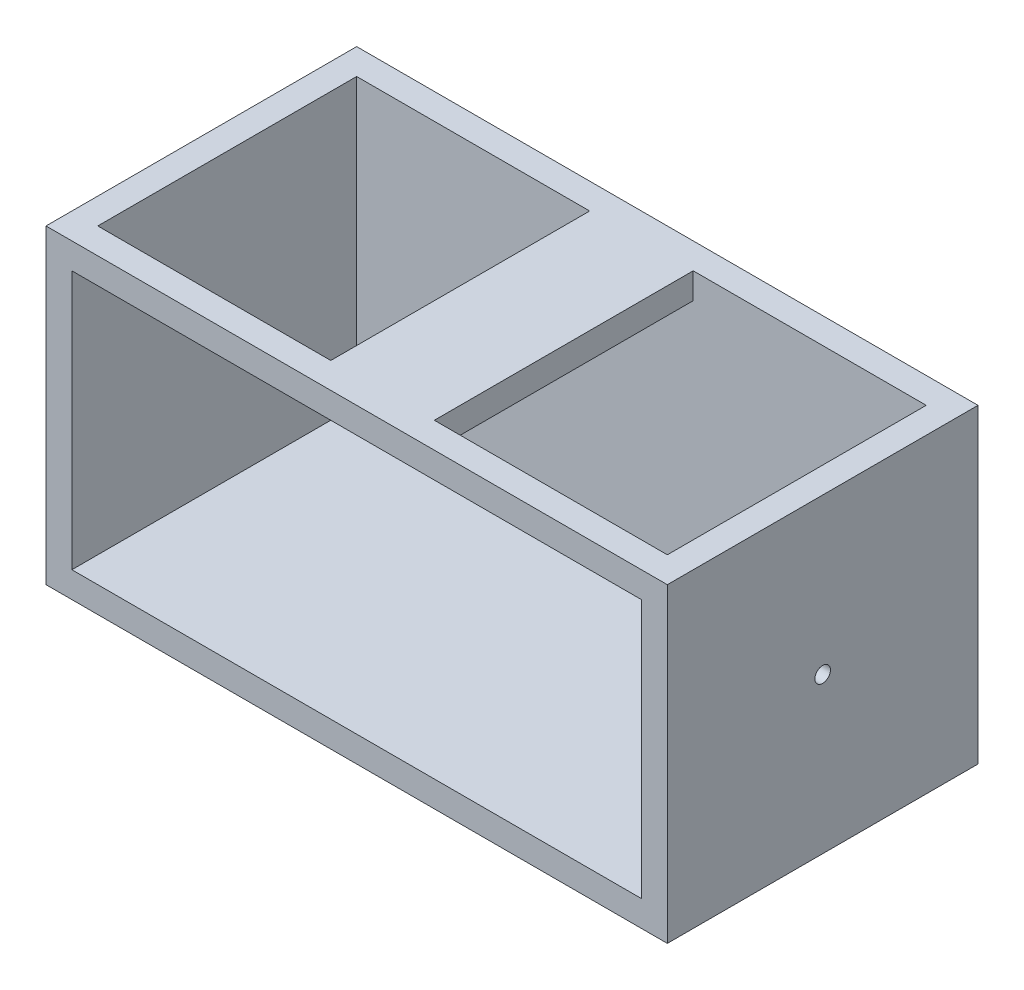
from build123d import *

# Parameters (mm, degrees)
SKETCH2_W           = 240
SKETCH2_H           = 120
BOSS_EXTRUDE1_DEPTH = 120
SKETCH3_R           = 3
CUT_EXTRUDE1_DEPTH  = 255
SHELL2_T            = -10
SKETCH5_W           = 220
SKETCH5_H           = 100
CUT_EXTRUDE2_DEPTH  = 158
SKETCH7_W           = 90
SKETCH7_H           = 100
CUT_EXTRUDE3_DEPTH  = 25
SKETCH8_W           = 90
SKETCH8_H           = 100
CUT_EXTRUDE4_DEPTH  = 25


with BuildPart() as part:
    # Sketch2 → Boss-Extrude1 (new body)
    with BuildSketch(Plane.XY):
        Rectangle(SKETCH2_W, SKETCH2_H)
    extrude(amount=BOSS_EXTRUDE1_DEPTH)

    # Sketch3 → Cut-Extrude1 (cut)
    with BuildSketch(Plane(origin=(120, 0, 0), x_dir=(0, 0, -1), z_dir=(1, 0, 0))):
        with Locations((-60, 0)):
            Circle(SKETCH3_R)
    extrude(amount=-CUT_EXTRUDE1_DEPTH, mode=Mode.SUBTRACT)

    # Shell2
    shell2_openings = [part.faces().sort_by_distance(p)[0] for p in [
        (0, 0, 120),
    ]]
    offset(amount=SHELL2_T, openings=shell2_openings, kind=Kind.INTERSECTION)

    # Sketch5 → Cut-Extrude2 (cut)
    with BuildSketch(Plane.XY.offset(10)):
        Rectangle(SKETCH5_W, SKETCH5_H)
    extrude(amount=CUT_EXTRUDE2_DEPTH, mode=Mode.SUBTRACT)

    # Sketch7 → Cut-Extrude3 (cut)
    with BuildSketch(Plane(origin=(0, 60, 0), x_dir=(1, 0, 0), z_dir=(0, 1, 0))):
        with Locations((65, -60)):
            Rectangle(SKETCH7_W, SKETCH7_H)
    extrude(amount=-CUT_EXTRUDE3_DEPTH, mode=Mode.SUBTRACT)

    # Sketch8 → Cut-Extrude4 (cut)
    with BuildSketch(Plane(origin=(0, 60, 0), x_dir=(1, 0, 0), z_dir=(0, 1, 0))):
        with Locations((-65, -60)):
            Rectangle(SKETCH8_W, SKETCH8_H)
    extrude(amount=-CUT_EXTRUDE4_DEPTH, mode=Mode.SUBTRACT)


solid = part.part
